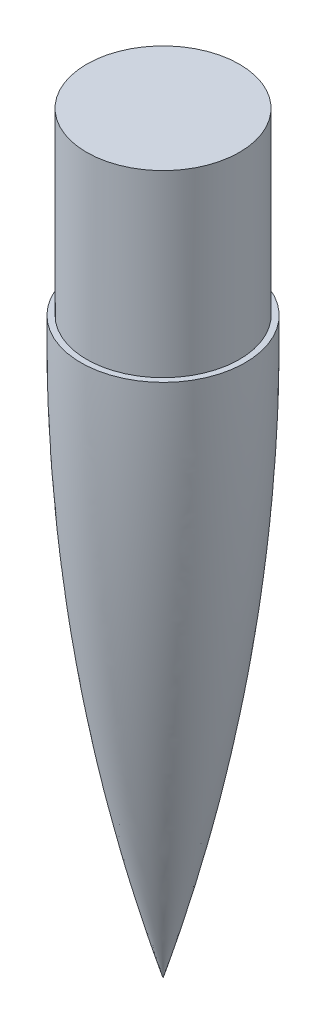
from build123d import *

# Parameters (mm, degrees)
SKETCH3_R      = 27.051
EXTRUDE1_DEPTH = 63.5


with BuildPart() as part:
    # Sketch2 → Revolve4 (revolve)
    with BuildSketch(Plane.XY):
        with BuildLine():
            Line((0, 0), (0, 203.2))
            Line((0, 203.2), (-29.083, 203.2))
            ThreePointArc((-29.083, 203.2), (-22.208786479, 100.502619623), (0, 0))
        make_face()
    revolve(axis=Axis((0, 0, 0), (0, 1, 0)))

    # Sketch3 → Extrude1 (add)
    with BuildSketch(Plane(origin=(0, 203.2, 0), x_dir=(-1, 0, 0), z_dir=(0, 1, 0))):
        with Locations(Location((0, 0, 0), (0, 0, 270))):
            Circle(SKETCH3_R)
    extrude(amount=EXTRUDE1_DEPTH)


solid = part.part
